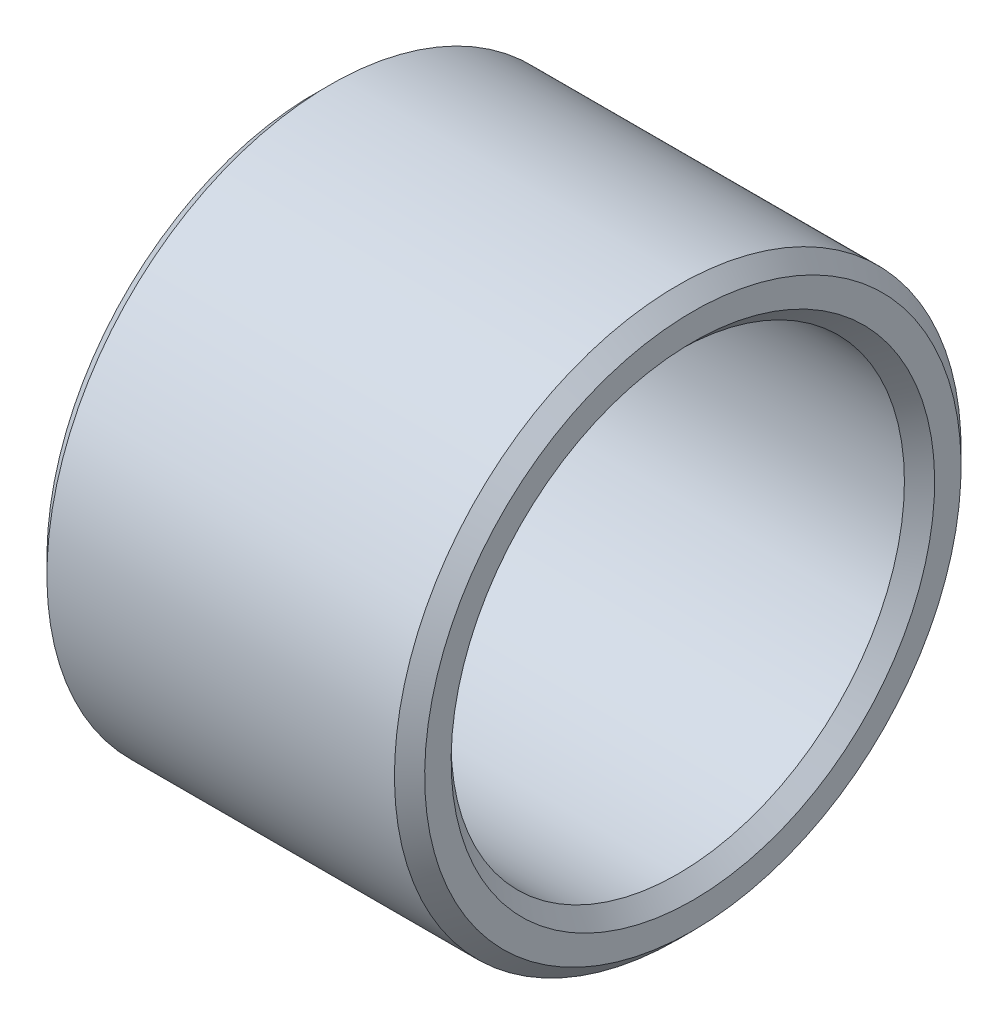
ISO-10303-21;
HEADER;
FILE_DESCRIPTION(('STEP AP214'),'2;1');
FILE_NAME('part.step','',(''),(''),'','','');
FILE_SCHEMA(('AUTOMOTIVE_DESIGN { 1 0 10303 214 1 1 1 1 }'));
ENDSEC;
DATA;
#1=APPLICATION_CONTEXT('core data for automotive mechanical design processes');
#2=APPLICATION_PROTOCOL_DEFINITION('international standard','automotive_design',2000,#1);
#3=PRODUCT_CONTEXT('',#1,'mechanical');
#4=PRODUCT('Part','Part','',(#3));
#5=PRODUCT_RELATED_PRODUCT_CATEGORY('part','',(#4));
#6=PRODUCT_DEFINITION_FORMATION('','',#4);
#7=PRODUCT_DEFINITION_CONTEXT('part definition',#1,'design');
#8=PRODUCT_DEFINITION('design','',#6,#7);
#9=PRODUCT_DEFINITION_SHAPE('','',#8);
#10=(LENGTH_UNIT() NAMED_UNIT(*) SI_UNIT(.MILLI.,.METRE.));
#11=(NAMED_UNIT(*) PLANE_ANGLE_UNIT() SI_UNIT($,.RADIAN.));
#12=(NAMED_UNIT(*) SI_UNIT($,.STERADIAN.) SOLID_ANGLE_UNIT());
#13=UNCERTAINTY_MEASURE_WITH_UNIT(LENGTH_MEASURE(1.E-05),#10,'distance_accuracy_value','');
#14=(GEOMETRIC_REPRESENTATION_CONTEXT(3) GLOBAL_UNCERTAINTY_ASSIGNED_CONTEXT((#13)) GLOBAL_UNIT_ASSIGNED_CONTEXT((#10,
#11,#12)) REPRESENTATION_CONTEXT('',''));
#15=CARTESIAN_POINT('',(0.,0.,0.));
#16=DIRECTION('',(0.,0.,1.));
#17=DIRECTION('',(1.,0.,0.));
#18=AXIS2_PLACEMENT_3D('',#15,#16,#17);
#19=CARTESIAN_POINT('',(0.,-6.75,0.));
#20=DIRECTION('',(-1.,0.,0.));
#21=DIRECTION('',(0.,1.,0.));
#22=AXIS2_PLACEMENT_3D('',#19,#20,#21);
#23=PLANE('',#22);
#24=CARTESIAN_POINT('',(0.,0.,0.));
#25=DIRECTION('',(1.,0.,0.));
#26=DIRECTION('',(0.,-1.,0.));
#27=AXIS2_PLACEMENT_3D('',#24,#25,#26);
#28=CIRCLE('',#27,6.4);
#29=CARTESIAN_POINT('',(0.,-6.4,0.));
#30=VERTEX_POINT('',#29);
#31=EDGE_CURVE('E9',#30,#30,#28,.T.);
#32=ORIENTED_EDGE('',*,*,#31,.T.);
#33=EDGE_LOOP('',(#32));
#34=FACE_BOUND('',#33,.T.);
#35=CARTESIAN_POINT('',(0.,0.,0.));
#36=DIRECTION('',(1.,0.,0.));
#37=DIRECTION('',(0.,-1.,0.));
#38=AXIS2_PLACEMENT_3D('',#35,#36,#37);
#39=CIRCLE('',#38,7.1);
#40=CARTESIAN_POINT('',(0.,-7.1,0.));
#41=VERTEX_POINT('',#40);
#42=EDGE_CURVE('E53',#41,#41,#39,.T.);
#43=ORIENTED_EDGE('',*,*,#42,.F.);
#44=EDGE_LOOP('',(#43));
#45=FACE_BOUND('',#44,.T.);
#46=ADVANCED_FACE('F15',(#34,#45),#23,.T.);
#47=CARTESIAN_POINT('',(0.2,0.,0.));
#48=DIRECTION('',(-1.,0.,0.));
#49=DIRECTION('',(0.,-1.,0.));
#50=AXIS2_PLACEMENT_3D('',#47,#48,#49);
#51=CONICAL_SURFACE('',#50,6.2,0.785398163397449);
#52=CARTESIAN_POINT('',(0.4,0.,0.));
#53=DIRECTION('',(1.,0.,0.));
#54=DIRECTION('',(0.,-1.,0.));
#55=AXIS2_PLACEMENT_3D('',#52,#53,#54);
#56=CIRCLE('',#55,6.);
#57=CARTESIAN_POINT('',(0.4,-6.,0.));
#58=VERTEX_POINT('',#57);
#59=EDGE_CURVE('E22',#58,#58,#56,.T.);
#60=ORIENTED_EDGE('',*,*,#59,.T.);
#61=EDGE_LOOP('',(#60));
#62=FACE_BOUND('',#61,.T.);
#63=ORIENTED_EDGE('',*,*,#31,.F.);
#64=EDGE_LOOP('',(#63));
#65=FACE_BOUND('',#64,.T.);
#66=ADVANCED_FACE('F82',(#62,#65),#51,.F.);
#67=CARTESIAN_POINT('',(5.,0.,0.));
#68=DIRECTION('',(-1.,0.,0.));
#69=DIRECTION('',(0.,-1.,0.));
#70=AXIS2_PLACEMENT_3D('',#67,#68,#69);
#71=CYLINDRICAL_SURFACE('',#70,6.);
#72=CARTESIAN_POINT('',(9.6,0.,0.));
#73=DIRECTION('',(1.,0.,0.));
#74=DIRECTION('',(0.,-1.,0.));
#75=AXIS2_PLACEMENT_3D('',#72,#73,#74);
#76=CIRCLE('',#75,6.);
#77=CARTESIAN_POINT('',(9.6,-6.,0.));
#78=VERTEX_POINT('',#77);
#79=EDGE_CURVE('E58',#78,#78,#76,.T.);
#80=ORIENTED_EDGE('',*,*,#79,.T.);
#81=EDGE_LOOP('',(#80));
#82=FACE_BOUND('',#81,.T.);
#83=ORIENTED_EDGE('',*,*,#59,.F.);
#84=EDGE_LOOP('',(#83));
#85=FACE_BOUND('',#84,.T.);
#86=ADVANCED_FACE('F66',(#82,#85),#71,.F.);
#87=CARTESIAN_POINT('',(9.8,0.,0.));
#88=DIRECTION('',(1.,0.,0.));
#89=DIRECTION('',(0.,-1.,0.));
#90=AXIS2_PLACEMENT_3D('',#87,#88,#89);
#91=CONICAL_SURFACE('',#90,6.2,0.785398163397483);
#92=CARTESIAN_POINT('',(10.,0.,0.));
#93=DIRECTION('',(1.,0.,0.));
#94=DIRECTION('',(0.,-1.,0.));
#95=AXIS2_PLACEMENT_3D('',#92,#93,#94);
#96=CIRCLE('',#95,6.4);
#97=CARTESIAN_POINT('',(10.,-6.4,0.));
#98=VERTEX_POINT('',#97);
#99=EDGE_CURVE('E63',#98,#98,#96,.T.);
#100=ORIENTED_EDGE('',*,*,#99,.T.);
#101=EDGE_LOOP('',(#100));
#102=FACE_BOUND('',#101,.T.);
#103=ORIENTED_EDGE('',*,*,#79,.F.);
#104=EDGE_LOOP('',(#103));
#105=FACE_BOUND('',#104,.T.);
#106=ADVANCED_FACE('F69',(#102,#105),#91,.F.);
#107=CARTESIAN_POINT('',(10.,-6.75,0.));
#108=DIRECTION('',(1.,0.,0.));
#109=DIRECTION('',(0.,-1.,0.));
#110=AXIS2_PLACEMENT_3D('',#107,#108,#109);
#111=PLANE('',#110);
#112=CARTESIAN_POINT('',(10.,0.,0.));
#113=DIRECTION('',(1.,0.,0.));
#114=DIRECTION('',(0.,-1.,0.));
#115=AXIS2_PLACEMENT_3D('',#112,#113,#114);
#116=CIRCLE('',#115,7.1);
#117=CARTESIAN_POINT('',(10.,-7.1,0.));
#118=VERTEX_POINT('',#117);
#119=EDGE_CURVE('E61',#118,#118,#116,.T.);
#120=ORIENTED_EDGE('',*,*,#119,.T.);
#121=EDGE_LOOP('',(#120));
#122=FACE_BOUND('',#121,.T.);
#123=ORIENTED_EDGE('',*,*,#99,.F.);
#124=EDGE_LOOP('',(#123));
#125=FACE_BOUND('',#124,.T.);
#126=ADVANCED_FACE('F71',(#122,#125),#111,.T.);
#127=CARTESIAN_POINT('',(9.8,0.,0.));
#128=DIRECTION('',(-1.,0.,0.));
#129=DIRECTION('',(0.,-1.,0.));
#130=AXIS2_PLACEMENT_3D('',#127,#128,#129);
#131=CONICAL_SURFACE('',#130,7.3,0.785398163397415);
#132=CARTESIAN_POINT('',(9.6,0.,0.));
#133=DIRECTION('',(1.,0.,0.));
#134=DIRECTION('',(0.,-1.,0.));
#135=AXIS2_PLACEMENT_3D('',#132,#133,#134);
#136=CIRCLE('',#135,7.5);
#137=CARTESIAN_POINT('',(9.6,-7.5,0.));
#138=VERTEX_POINT('',#137);
#139=EDGE_CURVE('E55',#138,#138,#136,.T.);
#140=ORIENTED_EDGE('',*,*,#139,.T.);
#141=EDGE_LOOP('',(#140));
#142=FACE_BOUND('',#141,.T.);
#143=ORIENTED_EDGE('',*,*,#119,.F.);
#144=EDGE_LOOP('',(#143));
#145=FACE_BOUND('',#144,.T.);
#146=ADVANCED_FACE('F79',(#142,#145),#131,.T.);
#147=CARTESIAN_POINT('',(5.,0.,0.));
#148=DIRECTION('',(-1.,0.,0.));
#149=DIRECTION('',(0.,-1.,0.));
#150=AXIS2_PLACEMENT_3D('',#147,#148,#149);
#151=CYLINDRICAL_SURFACE('',#150,7.5);
#152=CARTESIAN_POINT('',(0.4,0.,0.));
#153=DIRECTION('',(1.,0.,0.));
#154=DIRECTION('',(0.,-1.,0.));
#155=AXIS2_PLACEMENT_3D('',#152,#153,#154);
#156=CIRCLE('',#155,7.5);
#157=CARTESIAN_POINT('',(0.4,-7.5,0.));
#158=VERTEX_POINT('',#157);
#159=EDGE_CURVE('E49',#158,#158,#156,.T.);
#160=ORIENTED_EDGE('',*,*,#159,.T.);
#161=EDGE_LOOP('',(#160));
#162=FACE_BOUND('',#161,.T.);
#163=ORIENTED_EDGE('',*,*,#139,.F.);
#164=EDGE_LOOP('',(#163));
#165=FACE_BOUND('',#164,.T.);
#166=ADVANCED_FACE('F50',(#162,#165),#151,.T.);
#167=CARTESIAN_POINT('',(0.2,0.,0.));
#168=DIRECTION('',(1.,0.,0.));
#169=DIRECTION('',(0.,-1.,0.));
#170=AXIS2_PLACEMENT_3D('',#167,#168,#169);
#171=CONICAL_SURFACE('',#170,7.3,0.785398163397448);
#172=ORIENTED_EDGE('',*,*,#42,.T.);
#173=EDGE_LOOP('',(#172));
#174=FACE_BOUND('',#173,.T.);
#175=ORIENTED_EDGE('',*,*,#159,.F.);
#176=EDGE_LOOP('',(#175));
#177=FACE_BOUND('',#176,.T.);
#178=ADVANCED_FACE('F92',(#174,#177),#171,.T.);
#179=CLOSED_SHELL('',(#46,#66,#86,#106,#126,#146,#166,#178));
#180=MANIFOLD_SOLID_BREP('B1',#179);
#181=ADVANCED_BREP_SHAPE_REPRESENTATION('',(#18,#180),#14);
#182=SHAPE_DEFINITION_REPRESENTATION(#9,#181);
ENDSEC;
END-ISO-10303-21;
